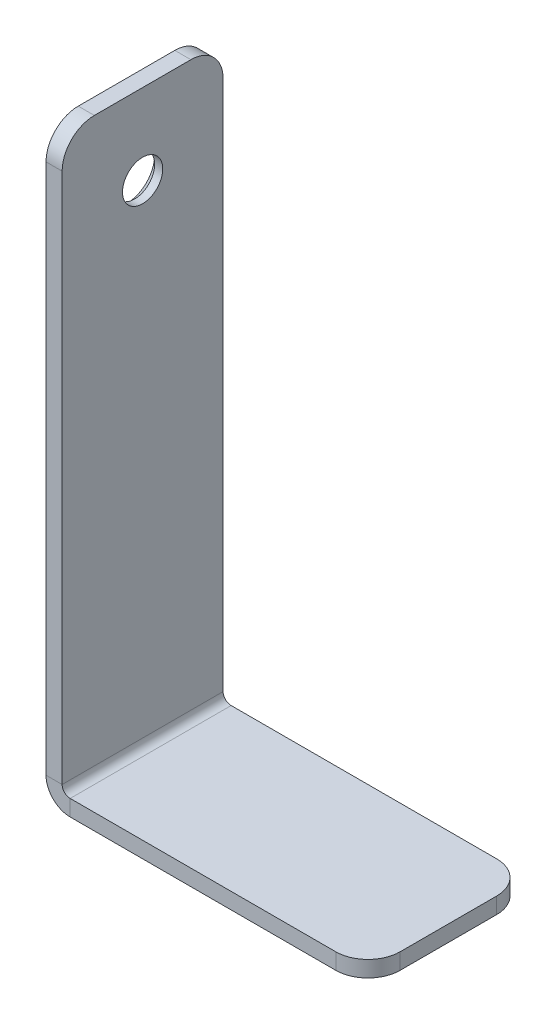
ISO-10303-21;
HEADER;
FILE_DESCRIPTION(('STEP AP214'),'2;1');
FILE_NAME('part.step','',(''),(''),'','','');
FILE_SCHEMA(('AUTOMOTIVE_DESIGN { 1 0 10303 214 1 1 1 1 }'));
ENDSEC;
DATA;
#1=APPLICATION_CONTEXT('core data for automotive mechanical design processes');
#2=APPLICATION_PROTOCOL_DEFINITION('international standard','automotive_design',2000,#1);
#3=PRODUCT_CONTEXT('',#1,'mechanical');
#4=PRODUCT('Part','Part','',(#3));
#5=PRODUCT_RELATED_PRODUCT_CATEGORY('part','',(#4));
#6=PRODUCT_DEFINITION_FORMATION('','',#4);
#7=PRODUCT_DEFINITION_CONTEXT('part definition',#1,'design');
#8=PRODUCT_DEFINITION('design','',#6,#7);
#9=PRODUCT_DEFINITION_SHAPE('','',#8);
#10=(LENGTH_UNIT() NAMED_UNIT(*) SI_UNIT(.MILLI.,.METRE.));
#11=(NAMED_UNIT(*) PLANE_ANGLE_UNIT() SI_UNIT($,.RADIAN.));
#12=(NAMED_UNIT(*) SI_UNIT($,.STERADIAN.) SOLID_ANGLE_UNIT());
#13=UNCERTAINTY_MEASURE_WITH_UNIT(LENGTH_MEASURE(1.E-05),#10,'distance_accuracy_value','');
#14=(GEOMETRIC_REPRESENTATION_CONTEXT(3) GLOBAL_UNCERTAINTY_ASSIGNED_CONTEXT((#13)) GLOBAL_UNIT_ASSIGNED_CONTEXT((#10,
#11,#12)) REPRESENTATION_CONTEXT('',''));
#15=CARTESIAN_POINT('',(0.,0.,0.));
#16=DIRECTION('',(0.,0.,1.));
#17=DIRECTION('',(1.,0.,0.));
#18=AXIS2_PLACEMENT_3D('',#15,#16,#17);
#19=CARTESIAN_POINT('',(0.,1.5,5.));
#20=DIRECTION('',(0.,0.,1.));
#21=DIRECTION('',(1.,0.,0.));
#22=AXIS2_PLACEMENT_3D('',#19,#20,#21);
#23=PLANE('',#22);
#24=DIRECTION('',(1.,0.,0.));
#25=VECTOR('',#24,1.);
#26=CARTESIAN_POINT('',(0.,1.5,5.));
#27=LINE('',#26,#25);
#28=CARTESIAN_POINT('',(0.,1.5,5.));
#29=VERTEX_POINT('',#28);
#30=CARTESIAN_POINT('',(1.,1.5,5.));
#31=VERTEX_POINT('',#30);
#32=EDGE_CURVE('E137',#29,#31,#27,.T.);
#33=ORIENTED_EDGE('',*,*,#32,.F.);
#34=CARTESIAN_POINT('',(1.5,1.5,5.));
#35=DIRECTION('',(0.,0.,-1.));
#36=DIRECTION('',(-1.,0.,0.));
#37=AXIS2_PLACEMENT_3D('',#34,#35,#36);
#38=CIRCLE('',#37,1.5);
#39=CARTESIAN_POINT('',(1.5,0.,5.));
#40=VERTEX_POINT('',#39);
#41=EDGE_CURVE('E135',#29,#40,#38,.F.);
#42=ORIENTED_EDGE('',*,*,#41,.T.);
#43=DIRECTION('',(0.,-1.,0.));
#44=VECTOR('',#43,1.);
#45=CARTESIAN_POINT('',(1.5,1.,5.));
#46=LINE('',#45,#44);
#47=CARTESIAN_POINT('',(1.5,1.,5.));
#48=VERTEX_POINT('',#47);
#49=EDGE_CURVE('E129',#48,#40,#46,.T.);
#50=ORIENTED_EDGE('',*,*,#49,.F.);
#51=CARTESIAN_POINT('',(1.5,1.5,5.));
#52=DIRECTION('',(0.,0.,1.));
#53=DIRECTION('',(1.,0.,0.));
#54=AXIS2_PLACEMENT_3D('',#51,#52,#53);
#55=CIRCLE('',#54,0.5);
#56=EDGE_CURVE('E133',#31,#48,#55,.T.);
#57=ORIENTED_EDGE('',*,*,#56,.F.);
#58=EDGE_LOOP('',(#33,#42,#50,#57));
#59=FACE_BOUND('',#58,.T.);
#60=ADVANCED_FACE('F36',(#59),#23,.T.);
#61=CARTESIAN_POINT('',(1.5,1.,5.));
#62=DIRECTION('',(0.,0.,1.));
#63=DIRECTION('',(1.,0.,0.));
#64=AXIS2_PLACEMENT_3D('',#61,#62,#63);
#65=PLANE('',#64);
#66=DIRECTION('',(0.,-1.,0.));
#67=VECTOR('',#66,1.);
#68=CARTESIAN_POINT('',(1.,36.5,5.));
#69=LINE('',#68,#67);
#70=CARTESIAN_POINT('',(1.,34.5,5.));
#71=VERTEX_POINT('',#70);
#72=EDGE_CURVE('E158',#71,#31,#69,.T.);
#73=ORIENTED_EDGE('',*,*,#72,.F.);
#74=DIRECTION('',(1.,0.,0.));
#75=VECTOR('',#74,1.);
#76=CARTESIAN_POINT('',(1.5,34.5,5.));
#77=LINE('',#76,#75);
#78=CARTESIAN_POINT('',(0.,34.5,5.));
#79=VERTEX_POINT('',#78);
#80=EDGE_CURVE('E215',#71,#79,#77,.F.);
#81=ORIENTED_EDGE('',*,*,#80,.T.);
#82=DIRECTION('',(0.,-1.,0.));
#83=VECTOR('',#82,1.);
#84=CARTESIAN_POINT('',(0.,36.5,5.));
#85=LINE('',#84,#83);
#86=EDGE_CURVE('E160',#79,#29,#85,.T.);
#87=ORIENTED_EDGE('',*,*,#86,.T.);
#88=ORIENTED_EDGE('',*,*,#32,.T.);
#89=EDGE_LOOP('',(#73,#81,#87,#88));
#90=FACE_BOUND('',#89,.T.);
#91=ADVANCED_FACE('F298',(#90),#65,.T.);
#92=CARTESIAN_POINT('',(1.5,0.,-5.));
#93=DIRECTION('',(0.,0.,-1.));
#94=DIRECTION('',(-1.,0.,0.));
#95=AXIS2_PLACEMENT_3D('',#92,#93,#94);
#96=PLANE('',#95);
#97=DIRECTION('',(0.,1.,0.));
#98=VECTOR('',#97,1.);
#99=CARTESIAN_POINT('',(1.5,0.,-5.));
#100=LINE('',#99,#98);
#101=CARTESIAN_POINT('',(1.5,0.,-5.));
#102=VERTEX_POINT('',#101);
#103=CARTESIAN_POINT('',(1.5,1.,-5.));
#104=VERTEX_POINT('',#103);
#105=EDGE_CURVE('E138',#102,#104,#100,.T.);
#106=ORIENTED_EDGE('',*,*,#105,.F.);
#107=CARTESIAN_POINT('',(1.5,1.5,-5.));
#108=DIRECTION('',(0.,0.,-1.));
#109=DIRECTION('',(-1.,0.,0.));
#110=AXIS2_PLACEMENT_3D('',#107,#108,#109);
#111=CIRCLE('',#110,1.5);
#112=CARTESIAN_POINT('',(0.,1.5,-5.));
#113=VERTEX_POINT('',#112);
#114=EDGE_CURVE('E178',#113,#102,#111,.F.);
#115=ORIENTED_EDGE('',*,*,#114,.F.);
#116=DIRECTION('',(-1.,0.,0.));
#117=VECTOR('',#116,1.);
#118=CARTESIAN_POINT('',(1.,1.5,-5.));
#119=LINE('',#118,#117);
#120=CARTESIAN_POINT('',(1.,1.5,-5.));
#121=VERTEX_POINT('',#120);
#122=EDGE_CURVE('E197',#121,#113,#119,.T.);
#123=ORIENTED_EDGE('',*,*,#122,.F.);
#124=CARTESIAN_POINT('',(1.5,1.5,-5.));
#125=DIRECTION('',(0.,0.,1.));
#126=DIRECTION('',(1.,0.,0.));
#127=AXIS2_PLACEMENT_3D('',#124,#125,#126);
#128=CIRCLE('',#127,0.5);
#129=EDGE_CURVE('E172',#121,#104,#128,.T.);
#130=ORIENTED_EDGE('',*,*,#129,.T.);
#131=EDGE_LOOP('',(#106,#115,#123,#130));
#132=FACE_BOUND('',#131,.T.);
#133=ADVANCED_FACE('F287',(#132),#96,.T.);
#134=CARTESIAN_POINT('',(1.,1.5,-5.));
#135=DIRECTION('',(0.,0.,-1.));
#136=DIRECTION('',(-1.,0.,0.));
#137=AXIS2_PLACEMENT_3D('',#134,#135,#136);
#138=PLANE('',#137);
#139=DIRECTION('',(1.,0.,0.));
#140=VECTOR('',#139,1.);
#141=CARTESIAN_POINT('',(0.,1.,-5.));
#142=LINE('',#141,#140);
#143=CARTESIAN_POINT('',(18.,1.,-5.));
#144=VERTEX_POINT('',#143);
#145=EDGE_CURVE('E145',#104,#144,#142,.T.);
#146=ORIENTED_EDGE('',*,*,#145,.T.);
#147=DIRECTION('',(0.,-1.,0.));
#148=VECTOR('',#147,1.);
#149=CARTESIAN_POINT('',(18.,1.5,-5.));
#150=LINE('',#149,#148);
#151=CARTESIAN_POINT('',(18.,0.,-5.));
#152=VERTEX_POINT('',#151);
#153=EDGE_CURVE('E11',#144,#152,#150,.T.);
#154=ORIENTED_EDGE('',*,*,#153,.T.);
#155=DIRECTION('',(1.,0.,0.));
#156=VECTOR('',#155,1.);
#157=CARTESIAN_POINT('',(0.,0.,-5.));
#158=LINE('',#157,#156);
#159=EDGE_CURVE('E167',#102,#152,#158,.T.);
#160=ORIENTED_EDGE('',*,*,#159,.F.);
#161=ORIENTED_EDGE('',*,*,#105,.T.);
#162=EDGE_LOOP('',(#146,#154,#160,#161));
#163=FACE_BOUND('',#162,.T.);
#164=ADVANCED_FACE('F290',(#163),#138,.T.);
#165=CARTESIAN_POINT('',(0.,0.,5.));
#166=DIRECTION('',(0.,1.,0.));
#167=DIRECTION('',(0.,0.,1.));
#168=AXIS2_PLACEMENT_3D('',#165,#166,#167);
#169=PLANE('',#168);
#170=DIRECTION('',(0.,0.,-1.));
#171=VECTOR('',#170,1.);
#172=CARTESIAN_POINT('',(20.,0.,5.));
#173=LINE('',#172,#171);
#174=CARTESIAN_POINT('',(20.,0.,3.));
#175=VERTEX_POINT('',#174);
#176=CARTESIAN_POINT('',(20.,0.,-3.));
#177=VERTEX_POINT('',#176);
#178=EDGE_CURVE('E194',#175,#177,#173,.T.);
#179=ORIENTED_EDGE('',*,*,#178,.F.);
#180=CARTESIAN_POINT('',(18.,0.,3.));
#181=DIRECTION('',(0.,1.,0.));
#182=DIRECTION('',(0.,0.,1.));
#183=AXIS2_PLACEMENT_3D('',#180,#181,#182);
#184=CIRCLE('',#183,2.);
#185=CARTESIAN_POINT('',(18.,0.,5.));
#186=VERTEX_POINT('',#185);
#187=EDGE_CURVE('E231',#175,#186,#184,.F.);
#188=ORIENTED_EDGE('',*,*,#187,.T.);
#189=DIRECTION('',(1.,0.,0.));
#190=VECTOR('',#189,1.);
#191=CARTESIAN_POINT('',(0.,0.,5.));
#192=LINE('',#191,#190);
#193=EDGE_CURVE('E153',#40,#186,#192,.T.);
#194=ORIENTED_EDGE('',*,*,#193,.F.);
#195=DIRECTION('',(0.,0.,-1.));
#196=VECTOR('',#195,1.);
#197=CARTESIAN_POINT('',(1.5,0.,5.));
#198=LINE('',#197,#196);
#199=EDGE_CURVE('E166',#40,#102,#198,.T.);
#200=ORIENTED_EDGE('',*,*,#199,.T.);
#201=ORIENTED_EDGE('',*,*,#159,.T.);
#202=CARTESIAN_POINT('',(18.,0.,-3.));
#203=DIRECTION('',(0.,1.,0.));
#204=DIRECTION('',(0.,0.,1.));
#205=AXIS2_PLACEMENT_3D('',#202,#203,#204);
#206=CIRCLE('',#205,2.);
#207=EDGE_CURVE('E229',#152,#177,#206,.F.);
#208=ORIENTED_EDGE('',*,*,#207,.T.);
#209=EDGE_LOOP('',(#179,#188,#194,#200,#201,#208));
#210=FACE_BOUND('',#209,.T.);
#211=ADVANCED_FACE('F244',(#210),#169,.F.);
#212=CARTESIAN_POINT('',(20.,1.,5.));
#213=DIRECTION('',(1.,0.,0.));
#214=DIRECTION('',(0.,0.,-1.));
#215=AXIS2_PLACEMENT_3D('',#212,#213,#214);
#216=PLANE('',#215);
#217=DIRECTION('',(0.,0.,-1.));
#218=VECTOR('',#217,1.);
#219=CARTESIAN_POINT('',(20.,1.,5.));
#220=LINE('',#219,#218);
#221=CARTESIAN_POINT('',(20.,1.,3.));
#222=VERTEX_POINT('',#221);
#223=CARTESIAN_POINT('',(20.,1.,-3.));
#224=VERTEX_POINT('',#223);
#225=EDGE_CURVE('E149',#222,#224,#220,.T.);
#226=ORIENTED_EDGE('',*,*,#225,.F.);
#227=DIRECTION('',(0.,-1.,0.));
#228=VECTOR('',#227,1.);
#229=CARTESIAN_POINT('',(20.,1.,3.));
#230=LINE('',#229,#228);
#231=EDGE_CURVE('E226',#222,#175,#230,.T.);
#232=ORIENTED_EDGE('',*,*,#231,.T.);
#233=ORIENTED_EDGE('',*,*,#178,.T.);
#234=DIRECTION('',(0.,-1.,0.));
#235=VECTOR('',#234,1.);
#236=CARTESIAN_POINT('',(20.,1.,-3.));
#237=LINE('',#236,#235);
#238=EDGE_CURVE('E224',#177,#224,#237,.F.);
#239=ORIENTED_EDGE('',*,*,#238,.T.);
#240=EDGE_LOOP('',(#226,#232,#233,#239));
#241=FACE_BOUND('',#240,.T.);
#242=ADVANCED_FACE('F238',(#241),#216,.T.);
#243=CARTESIAN_POINT('',(0.,1.,5.));
#244=DIRECTION('',(0.,1.,0.));
#245=DIRECTION('',(0.,0.,1.));
#246=AXIS2_PLACEMENT_3D('',#243,#244,#245);
#247=PLANE('',#246);
#248=DIRECTION('',(1.,0.,0.));
#249=VECTOR('',#248,1.);
#250=CARTESIAN_POINT('',(0.,1.,5.));
#251=LINE('',#250,#249);
#252=CARTESIAN_POINT('',(18.,1.,5.));
#253=VERTEX_POINT('',#252);
#254=EDGE_CURVE('E143',#48,#253,#251,.T.);
#255=ORIENTED_EDGE('',*,*,#254,.T.);
#256=CARTESIAN_POINT('',(18.,1.,3.));
#257=DIRECTION('',(0.,1.,0.));
#258=DIRECTION('',(0.,0.,1.));
#259=AXIS2_PLACEMENT_3D('',#256,#257,#258);
#260=CIRCLE('',#259,2.);
#261=EDGE_CURVE('E44',#253,#222,#260,.T.);
#262=ORIENTED_EDGE('',*,*,#261,.T.);
#263=ORIENTED_EDGE('',*,*,#225,.T.);
#264=CARTESIAN_POINT('',(18.,1.,-3.));
#265=DIRECTION('',(0.,1.,0.));
#266=DIRECTION('',(0.,0.,1.));
#267=AXIS2_PLACEMENT_3D('',#264,#265,#266);
#268=CIRCLE('',#267,2.);
#269=EDGE_CURVE('E51',#224,#144,#268,.T.);
#270=ORIENTED_EDGE('',*,*,#269,.T.);
#271=ORIENTED_EDGE('',*,*,#145,.F.);
#272=DIRECTION('',(0.,0.,-1.));
#273=VECTOR('',#272,1.);
#274=CARTESIAN_POINT('',(1.5,1.,5.));
#275=LINE('',#274,#273);
#276=EDGE_CURVE('E141',#48,#104,#275,.T.);
#277=ORIENTED_EDGE('',*,*,#276,.F.);
#278=EDGE_LOOP('',(#255,#262,#263,#270,#271,#277));
#279=FACE_BOUND('',#278,.T.);
#280=ADVANCED_FACE('F142',(#279),#247,.T.);
#281=CARTESIAN_POINT('',(1.5,1.5,5.));
#282=DIRECTION('',(0.,0.,-1.));
#283=DIRECTION('',(-1.,0.,0.));
#284=AXIS2_PLACEMENT_3D('',#281,#282,#283);
#285=CYLINDRICAL_SURFACE('',#284,0.5);
#286=ORIENTED_EDGE('',*,*,#129,.F.);
#287=DIRECTION('',(0.,0.,-1.));
#288=VECTOR('',#287,1.);
#289=CARTESIAN_POINT('',(1.,1.5,5.));
#290=LINE('',#289,#288);
#291=EDGE_CURVE('E150',#31,#121,#290,.T.);
#292=ORIENTED_EDGE('',*,*,#291,.F.);
#293=ORIENTED_EDGE('',*,*,#56,.T.);
#294=ORIENTED_EDGE('',*,*,#276,.T.);
#295=EDGE_LOOP('',(#286,#292,#293,#294));
#296=FACE_BOUND('',#295,.T.);
#297=ADVANCED_FACE('F156',(#296),#285,.F.);
#298=CARTESIAN_POINT('',(1.,36.5,5.));
#299=DIRECTION('',(1.,0.,0.));
#300=DIRECTION('',(0.,1.,0.));
#301=AXIS2_PLACEMENT_3D('',#298,#299,#300);
#302=PLANE('',#301);
#303=CARTESIAN_POINT('',(1.,31.5,0.));
#304=DIRECTION('',(1.,0.,0.));
#305=DIRECTION('',(0.,1.,0.));
#306=AXIS2_PLACEMENT_3D('',#303,#304,#305);
#307=CIRCLE('',#306,1.24999999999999);
#308=CARTESIAN_POINT('',(1.,32.75,0.));
#309=VERTEX_POINT('',#308);
#310=EDGE_CURVE('E170',#309,#309,#307,.T.);
#311=ORIENTED_EDGE('',*,*,#310,.F.);
#312=EDGE_LOOP('',(#311));
#313=FACE_BOUND('',#312,.T.);
#314=DIRECTION('',(0.,0.,-1.));
#315=VECTOR('',#314,1.);
#316=CARTESIAN_POINT('',(1.,36.5,5.));
#317=LINE('',#316,#315);
#318=CARTESIAN_POINT('',(1.,36.5,3.));
#319=VERTEX_POINT('',#318);
#320=CARTESIAN_POINT('',(1.,36.5,-3.));
#321=VERTEX_POINT('',#320);
#322=EDGE_CURVE('E189',#319,#321,#317,.T.);
#323=ORIENTED_EDGE('',*,*,#322,.F.);
#324=CARTESIAN_POINT('',(1.,34.5,3.));
#325=DIRECTION('',(1.,0.,0.));
#326=DIRECTION('',(0.,1.,0.));
#327=AXIS2_PLACEMENT_3D('',#324,#325,#326);
#328=CIRCLE('',#327,2.);
#329=EDGE_CURVE('E213',#319,#71,#328,.T.);
#330=ORIENTED_EDGE('',*,*,#329,.T.);
#331=ORIENTED_EDGE('',*,*,#72,.T.);
#332=ORIENTED_EDGE('',*,*,#291,.T.);
#333=DIRECTION('',(0.,-1.,0.));
#334=VECTOR('',#333,1.);
#335=CARTESIAN_POINT('',(1.,36.5,-5.));
#336=LINE('',#335,#334);
#337=CARTESIAN_POINT('',(1.,34.5,-5.));
#338=VERTEX_POINT('',#337);
#339=EDGE_CURVE('E174',#338,#121,#336,.T.);
#340=ORIENTED_EDGE('',*,*,#339,.F.);
#341=CARTESIAN_POINT('',(1.,34.5,-3.));
#342=DIRECTION('',(1.,0.,0.));
#343=DIRECTION('',(0.,1.,0.));
#344=AXIS2_PLACEMENT_3D('',#341,#342,#343);
#345=CIRCLE('',#344,2.);
#346=EDGE_CURVE('E211',#338,#321,#345,.T.);
#347=ORIENTED_EDGE('',*,*,#346,.T.);
#348=EDGE_LOOP('',(#323,#330,#331,#332,#340,#347));
#349=FACE_BOUND('',#348,.T.);
#350=ADVANCED_FACE('F273',(#313,#349),#302,.T.);
#351=CARTESIAN_POINT('',(0.,36.5,5.));
#352=DIRECTION('',(0.,1.,0.));
#353=DIRECTION('',(0.,0.,1.));
#354=AXIS2_PLACEMENT_3D('',#351,#352,#353);
#355=PLANE('',#354);
#356=DIRECTION('',(0.,0.,-1.));
#357=VECTOR('',#356,1.);
#358=CARTESIAN_POINT('',(0.,36.5,5.));
#359=LINE('',#358,#357);
#360=CARTESIAN_POINT('',(0.,36.5,3.));
#361=VERTEX_POINT('',#360);
#362=CARTESIAN_POINT('',(0.,36.5,-3.));
#363=VERTEX_POINT('',#362);
#364=EDGE_CURVE('E186',#361,#363,#359,.T.);
#365=ORIENTED_EDGE('',*,*,#364,.F.);
#366=DIRECTION('',(1.,0.,0.));
#367=VECTOR('',#366,1.);
#368=CARTESIAN_POINT('',(0.,36.5,3.));
#369=LINE('',#368,#367);
#370=EDGE_CURVE('E208',#361,#319,#369,.T.);
#371=ORIENTED_EDGE('',*,*,#370,.T.);
#372=ORIENTED_EDGE('',*,*,#322,.T.);
#373=DIRECTION('',(1.,0.,0.));
#374=VECTOR('',#373,1.);
#375=CARTESIAN_POINT('',(0.,36.5,-3.));
#376=LINE('',#375,#374);
#377=EDGE_CURVE('E203',#321,#363,#376,.F.);
#378=ORIENTED_EDGE('',*,*,#377,.T.);
#379=EDGE_LOOP('',(#365,#371,#372,#378));
#380=FACE_BOUND('',#379,.T.);
#381=ADVANCED_FACE('F258',(#380),#355,.T.);
#382=CARTESIAN_POINT('',(0.,36.5,5.));
#383=DIRECTION('',(1.,0.,0.));
#384=DIRECTION('',(0.,1.,0.));
#385=AXIS2_PLACEMENT_3D('',#382,#383,#384);
#386=PLANE('',#385);
#387=CARTESIAN_POINT('',(0.,31.5,0.));
#388=DIRECTION('',(-1.,0.,0.));
#389=DIRECTION('',(0.,0.,1.));
#390=AXIS2_PLACEMENT_3D('',#387,#388,#389);
#391=CIRCLE('',#390,1.75);
#392=CARTESIAN_POINT('',(0.,31.5,1.75000000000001));
#393=VERTEX_POINT('',#392);
#394=EDGE_CURVE('E248',#393,#393,#391,.T.);
#395=ORIENTED_EDGE('',*,*,#394,.F.);
#396=EDGE_LOOP('',(#395));
#397=FACE_BOUND('',#396,.T.);
#398=ORIENTED_EDGE('',*,*,#86,.F.);
#399=CARTESIAN_POINT('',(0.,34.5,3.));
#400=DIRECTION('',(1.,0.,0.));
#401=DIRECTION('',(0.,1.,0.));
#402=AXIS2_PLACEMENT_3D('',#399,#400,#401);
#403=CIRCLE('',#402,2.);
#404=EDGE_CURVE('E219',#79,#361,#403,.F.);
#405=ORIENTED_EDGE('',*,*,#404,.T.);
#406=ORIENTED_EDGE('',*,*,#364,.T.);
#407=CARTESIAN_POINT('',(0.,34.5,-3.));
#408=DIRECTION('',(1.,0.,0.));
#409=DIRECTION('',(0.,1.,0.));
#410=AXIS2_PLACEMENT_3D('',#407,#408,#409);
#411=CIRCLE('',#410,2.);
#412=CARTESIAN_POINT('',(0.,34.5,-5.));
#413=VERTEX_POINT('',#412);
#414=EDGE_CURVE('E217',#363,#413,#411,.F.);
#415=ORIENTED_EDGE('',*,*,#414,.T.);
#416=DIRECTION('',(0.,-1.,0.));
#417=VECTOR('',#416,1.);
#418=CARTESIAN_POINT('',(0.,36.5,-5.));
#419=LINE('',#418,#417);
#420=EDGE_CURVE('E176',#413,#113,#419,.T.);
#421=ORIENTED_EDGE('',*,*,#420,.T.);
#422=DIRECTION('',(0.,0.,-1.));
#423=VECTOR('',#422,1.);
#424=CARTESIAN_POINT('',(0.,1.5,5.));
#425=LINE('',#424,#423);
#426=EDGE_CURVE('E183',#29,#113,#425,.T.);
#427=ORIENTED_EDGE('',*,*,#426,.F.);
#428=EDGE_LOOP('',(#398,#405,#406,#415,#421,#427));
#429=FACE_BOUND('',#428,.T.);
#430=ADVANCED_FACE('F254',(#397,#429),#386,.F.);
#431=CARTESIAN_POINT('',(1.5,1.5,5.));
#432=DIRECTION('',(0.,0.,-1.));
#433=DIRECTION('',(-1.,0.,0.));
#434=AXIS2_PLACEMENT_3D('',#431,#432,#433);
#435=CYLINDRICAL_SURFACE('',#434,1.5);
#436=ORIENTED_EDGE('',*,*,#114,.T.);
#437=ORIENTED_EDGE('',*,*,#199,.F.);
#438=ORIENTED_EDGE('',*,*,#41,.F.);
#439=ORIENTED_EDGE('',*,*,#426,.T.);
#440=EDGE_LOOP('',(#436,#437,#438,#439));
#441=FACE_BOUND('',#440,.T.);
#442=ADVANCED_FACE('F257',(#441),#435,.T.);
#443=CARTESIAN_POINT('',(1.5,1.5,5.));
#444=DIRECTION('',(0.,0.,1.));
#445=DIRECTION('',(1.,0.,0.));
#446=AXIS2_PLACEMENT_3D('',#443,#444,#445);
#447=PLANE('',#446);
#448=ORIENTED_EDGE('',*,*,#193,.T.);
#449=DIRECTION('',(0.,-1.,0.));
#450=VECTOR('',#449,1.);
#451=CARTESIAN_POINT('',(18.,1.5,5.));
#452=LINE('',#451,#450);
#453=EDGE_CURVE('E59',#186,#253,#452,.F.);
#454=ORIENTED_EDGE('',*,*,#453,.T.);
#455=ORIENTED_EDGE('',*,*,#254,.F.);
#456=ORIENTED_EDGE('',*,*,#49,.T.);
#457=EDGE_LOOP('',(#448,#454,#455,#456));
#458=FACE_BOUND('',#457,.T.);
#459=ADVANCED_FACE('F152',(#458),#447,.T.);
#460=CARTESIAN_POINT('',(1.5,1.5,-5.));
#461=DIRECTION('',(0.,0.,1.));
#462=DIRECTION('',(1.,0.,0.));
#463=AXIS2_PLACEMENT_3D('',#460,#461,#462);
#464=PLANE('',#463);
#465=ORIENTED_EDGE('',*,*,#420,.F.);
#466=DIRECTION('',(1.,0.,0.));
#467=VECTOR('',#466,1.);
#468=CARTESIAN_POINT('',(1.,34.5,-5.));
#469=LINE('',#468,#467);
#470=EDGE_CURVE('E221',#413,#338,#469,.T.);
#471=ORIENTED_EDGE('',*,*,#470,.T.);
#472=ORIENTED_EDGE('',*,*,#339,.T.);
#473=ORIENTED_EDGE('',*,*,#122,.T.);
#474=EDGE_LOOP('',(#465,#471,#472,#473));
#475=FACE_BOUND('',#474,.T.);
#476=ADVANCED_FACE('F282',(#475),#464,.F.);
#477=CARTESIAN_POINT('',(0.,31.5,0.));
#478=DIRECTION('',(-1.,0.,0.));
#479=DIRECTION('',(0.,0.,1.));
#480=AXIS2_PLACEMENT_3D('',#477,#478,#479);
#481=CYLINDRICAL_SURFACE('',#480,1.24999999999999);
#482=ORIENTED_EDGE('',*,*,#310,.T.);
#483=EDGE_LOOP('',(#482));
#484=FACE_BOUND('',#483,.T.);
#485=CARTESIAN_POINT('',(0.500000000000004,31.5,0.));
#486=DIRECTION('',(-1.,0.,0.));
#487=DIRECTION('',(0.,0.,1.));
#488=AXIS2_PLACEMENT_3D('',#485,#486,#487);
#489=CIRCLE('',#488,1.24999999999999);
#490=CARTESIAN_POINT('',(0.500000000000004,31.5,1.25));
#491=VERTEX_POINT('',#490);
#492=EDGE_CURVE('E206',#491,#491,#489,.T.);
#493=ORIENTED_EDGE('',*,*,#492,.T.);
#494=EDGE_LOOP('',(#493));
#495=FACE_BOUND('',#494,.T.);
#496=ADVANCED_FACE('F338',(#484,#495),#481,.F.);
#497=CARTESIAN_POINT('',(0.,31.5,0.));
#498=DIRECTION('',(-1.,0.,0.));
#499=DIRECTION('',(0.,0.,1.));
#500=AXIS2_PLACEMENT_3D('',#497,#498,#499);
#501=CONICAL_SURFACE('',#500,1.75,0.785398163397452);
#502=ORIENTED_EDGE('',*,*,#492,.F.);
#503=EDGE_LOOP('',(#502));
#504=FACE_BOUND('',#503,.T.);
#505=ORIENTED_EDGE('',*,*,#394,.T.);
#506=EDGE_LOOP('',(#505));
#507=FACE_BOUND('',#506,.T.);
#508=ADVANCED_FACE('F252',(#504,#507),#501,.F.);
#509=CARTESIAN_POINT('',(0.,34.5,3.));
#510=DIRECTION('',(1.,0.,0.));
#511=DIRECTION('',(0.,0.,-1.));
#512=AXIS2_PLACEMENT_3D('',#509,#510,#511);
#513=CYLINDRICAL_SURFACE('',#512,2.);
#514=ORIENTED_EDGE('',*,*,#404,.F.);
#515=ORIENTED_EDGE('',*,*,#80,.F.);
#516=ORIENTED_EDGE('',*,*,#329,.F.);
#517=ORIENTED_EDGE('',*,*,#370,.F.);
#518=EDGE_LOOP('',(#514,#515,#516,#517));
#519=FACE_BOUND('',#518,.T.);
#520=ADVANCED_FACE('F268',(#519),#513,.T.);
#521=CARTESIAN_POINT('',(1.5,34.5,-3.));
#522=DIRECTION('',(-1.,0.,0.));
#523=DIRECTION('',(0.,0.,1.));
#524=AXIS2_PLACEMENT_3D('',#521,#522,#523);
#525=CYLINDRICAL_SURFACE('',#524,2.);
#526=ORIENTED_EDGE('',*,*,#414,.F.);
#527=ORIENTED_EDGE('',*,*,#377,.F.);
#528=ORIENTED_EDGE('',*,*,#346,.F.);
#529=ORIENTED_EDGE('',*,*,#470,.F.);
#530=EDGE_LOOP('',(#526,#527,#528,#529));
#531=FACE_BOUND('',#530,.T.);
#532=ADVANCED_FACE('F279',(#531),#525,.T.);
#533=CARTESIAN_POINT('',(18.,1.,3.));
#534=DIRECTION('',(0.,-1.,0.));
#535=DIRECTION('',(0.,0.,-1.));
#536=AXIS2_PLACEMENT_3D('',#533,#534,#535);
#537=CYLINDRICAL_SURFACE('',#536,2.);
#538=ORIENTED_EDGE('',*,*,#261,.F.);
#539=ORIENTED_EDGE('',*,*,#453,.F.);
#540=ORIENTED_EDGE('',*,*,#187,.F.);
#541=ORIENTED_EDGE('',*,*,#231,.F.);
#542=EDGE_LOOP('',(#538,#539,#540,#541));
#543=FACE_BOUND('',#542,.T.);
#544=ADVANCED_FACE('F241',(#543),#537,.T.);
#545=CARTESIAN_POINT('',(18.,1.5,-3.));
#546=DIRECTION('',(0.,-1.,0.));
#547=DIRECTION('',(0.,0.,-1.));
#548=AXIS2_PLACEMENT_3D('',#545,#546,#547);
#549=CYLINDRICAL_SURFACE('',#548,2.);
#550=ORIENTED_EDGE('',*,*,#269,.F.);
#551=ORIENTED_EDGE('',*,*,#238,.F.);
#552=ORIENTED_EDGE('',*,*,#207,.F.);
#553=ORIENTED_EDGE('',*,*,#153,.F.);
#554=EDGE_LOOP('',(#550,#551,#552,#553));
#555=FACE_BOUND('',#554,.T.);
#556=ADVANCED_FACE('F38',(#555),#549,.T.);
#557=CLOSED_SHELL('',(#60,#91,#133,#164,#211,#242,#280,#297,#350,#381,#430,#442,#459,#476,#496,
#508,#520,#532,#544,#556));
#558=MANIFOLD_SOLID_BREP('B2',#557);
#559=ADVANCED_BREP_SHAPE_REPRESENTATION('',(#18,#558),#14);
#560=SHAPE_DEFINITION_REPRESENTATION(#9,#559);
ENDSEC;
END-ISO-10303-21;
